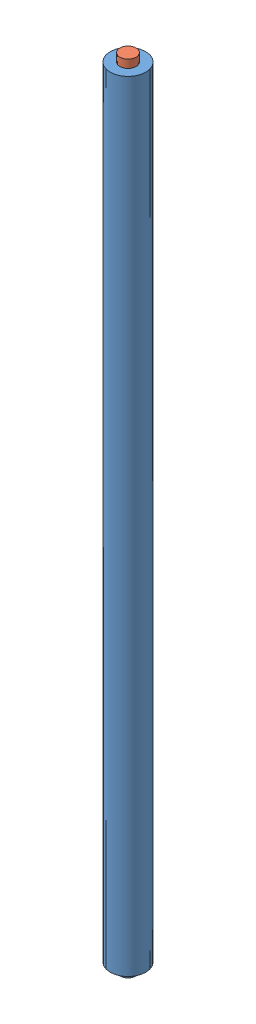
SolidWorks assembly GasShockASM.SLDASM, configuration Default (file format 8000). Lengths in mm.
Overall size (22 491 22).
2 component instances, 2 part files, 2 mates.
Components (placement in the parent):
- GAS rear-1: GAS rear.SLDPRT [Default] at (222.6362 -30.0382 378.916) size (22 486 22)
- GAS front-1: GAS front.SLDPRT [Default] at (222.6362 -430.0382 378.916) x (-0.92974 0 -0.368215) z (0.368215 0 -0.92974) size (10 405 10)
Mates (geometry in assembly coordinates):
- Concentric1: concentric aligned: cylinder of GAS rear-1 through (222.6362 455.9618 378.916) axis (0 1 0) radius 11; cylinder of GAS front-1 through (222.6362 455.9618 378.916) axis (0 1 0) radius 5
- LimitDistance2: limit distance aligned: plane of GAS front-1 through (222.6362 455.9618 378.916) normal (0 1 0); plane of GAS rear-1 through (233.6362 455.9618 378.916) normal (0 1 0)
